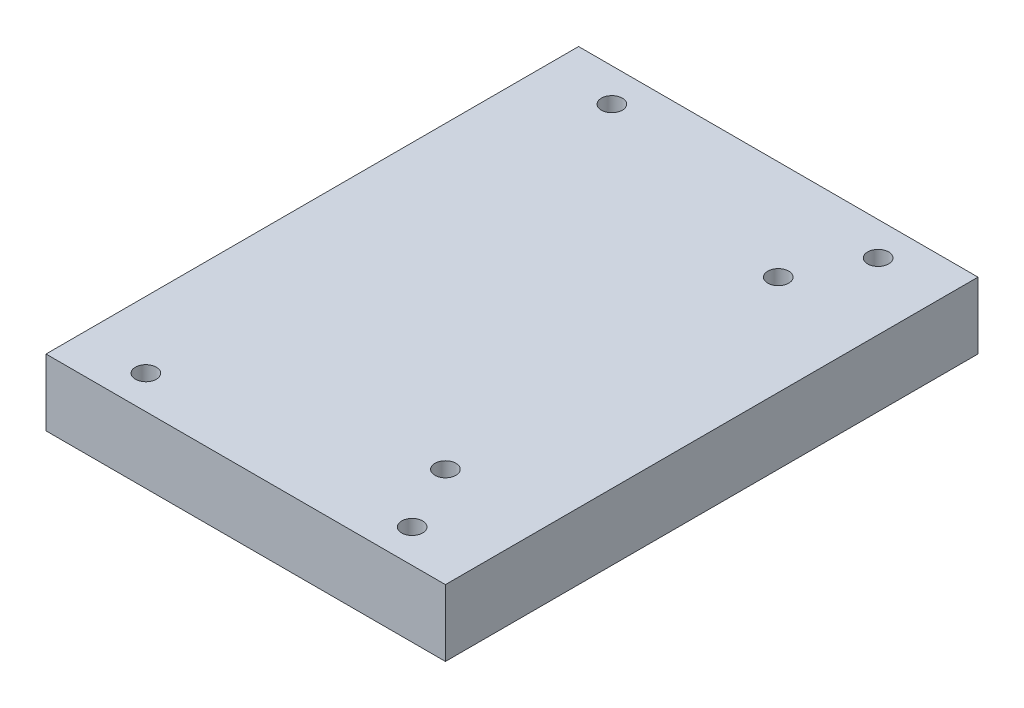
ISO-10303-21;
HEADER;
FILE_DESCRIPTION(('STEP AP214'),'2;1');
FILE_NAME('part.step','',(''),(''),'','','');
FILE_SCHEMA(('AUTOMOTIVE_DESIGN { 1 0 10303 214 1 1 1 1 }'));
ENDSEC;
DATA;
#1=APPLICATION_CONTEXT('core data for automotive mechanical design processes');
#2=APPLICATION_PROTOCOL_DEFINITION('international standard','automotive_design',2000,#1);
#3=PRODUCT_CONTEXT('',#1,'mechanical');
#4=PRODUCT('Part','Part','',(#3));
#5=PRODUCT_RELATED_PRODUCT_CATEGORY('part','',(#4));
#6=PRODUCT_DEFINITION_FORMATION('','',#4);
#7=PRODUCT_DEFINITION_CONTEXT('part definition',#1,'design');
#8=PRODUCT_DEFINITION('design','',#6,#7);
#9=PRODUCT_DEFINITION_SHAPE('','',#8);
#10=(LENGTH_UNIT() NAMED_UNIT(*) SI_UNIT(.MILLI.,.METRE.));
#11=(NAMED_UNIT(*) PLANE_ANGLE_UNIT() SI_UNIT($,.RADIAN.));
#12=(NAMED_UNIT(*) SI_UNIT($,.STERADIAN.) SOLID_ANGLE_UNIT());
#13=UNCERTAINTY_MEASURE_WITH_UNIT(LENGTH_MEASURE(1.E-05),#10,'distance_accuracy_value','');
#14=(GEOMETRIC_REPRESENTATION_CONTEXT(3) GLOBAL_UNCERTAINTY_ASSIGNED_CONTEXT((#13)) GLOBAL_UNIT_ASSIGNED_CONTEXT((#10,
#11,#12)) REPRESENTATION_CONTEXT('',''));
#15=CARTESIAN_POINT('',(0.,0.,0.));
#16=DIRECTION('',(0.,0.,1.));
#17=DIRECTION('',(1.,0.,0.));
#18=AXIS2_PLACEMENT_3D('',#15,#16,#17);
#19=CARTESIAN_POINT('',(-123.989038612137,12.7,-27.4707877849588));
#20=DIRECTION('',(1.,0.,0.));
#21=DIRECTION('',(0.,0.,-1.));
#22=AXIS2_PLACEMENT_3D('',#19,#20,#21);
#23=PLANE('',#22);
#24=DIRECTION('',(0.,0.,1.));
#25=VECTOR('',#24,1.);
#26=CARTESIAN_POINT('',(-123.989038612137,0.,-27.4707877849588));
#27=LINE('',#26,#25);
#28=CARTESIAN_POINT('',(-123.989038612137,0.,-27.4707877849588));
#29=VERTEX_POINT('',#28);
#30=CARTESIAN_POINT('',(-123.989038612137,0.,74.1292122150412));
#31=VERTEX_POINT('',#30);
#32=EDGE_CURVE('E96',#29,#31,#27,.T.);
#33=ORIENTED_EDGE('',*,*,#32,.T.);
#34=DIRECTION('',(0.,-1.,0.));
#35=VECTOR('',#34,1.);
#36=CARTESIAN_POINT('',(-123.989038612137,12.7,74.1292122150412));
#37=LINE('',#36,#35);
#38=CARTESIAN_POINT('',(-123.989038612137,12.7,74.1292122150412));
#39=VERTEX_POINT('',#38);
#40=EDGE_CURVE('E11',#39,#31,#37,.T.);
#41=ORIENTED_EDGE('',*,*,#40,.F.);
#42=DIRECTION('',(0.,0.,1.));
#43=VECTOR('',#42,1.);
#44=CARTESIAN_POINT('',(-123.989038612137,12.7,-27.4707877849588));
#45=LINE('',#44,#43);
#46=CARTESIAN_POINT('',(-123.989038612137,12.7,-27.4707877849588));
#47=VERTEX_POINT('',#46);
#48=EDGE_CURVE('E84',#47,#39,#45,.T.);
#49=ORIENTED_EDGE('',*,*,#48,.F.);
#50=DIRECTION('',(0.,-1.,0.));
#51=VECTOR('',#50,1.);
#52=CARTESIAN_POINT('',(-123.989038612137,12.7,-27.4707877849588));
#53=LINE('',#52,#51);
#54=EDGE_CURVE('E92',#47,#29,#53,.T.);
#55=ORIENTED_EDGE('',*,*,#54,.T.);
#56=EDGE_LOOP('',(#33,#41,#49,#55));
#57=FACE_BOUND('',#56,.T.);
#58=ADVANCED_FACE('F33',(#57),#23,.F.);
#59=CARTESIAN_POINT('',(-123.989038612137,12.7,74.1292122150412));
#60=DIRECTION('',(0.,0.,-1.));
#61=DIRECTION('',(-1.,0.,0.));
#62=AXIS2_PLACEMENT_3D('',#59,#60,#61);
#63=PLANE('',#62);
#64=DIRECTION('',(1.,0.,0.));
#65=VECTOR('',#64,1.);
#66=CARTESIAN_POINT('',(-123.989038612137,0.,74.1292122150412));
#67=LINE('',#66,#65);
#68=CARTESIAN_POINT('',(-47.7890386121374,0.,74.1292122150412));
#69=VERTEX_POINT('',#68);
#70=EDGE_CURVE('E88',#31,#69,#67,.T.);
#71=ORIENTED_EDGE('',*,*,#70,.T.);
#72=DIRECTION('',(0.,-1.,0.));
#73=VECTOR('',#72,1.);
#74=CARTESIAN_POINT('',(-47.7890386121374,12.7,74.1292122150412));
#75=LINE('',#74,#73);
#76=CARTESIAN_POINT('',(-47.7890386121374,12.7,74.1292122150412));
#77=VERTEX_POINT('',#76);
#78=EDGE_CURVE('E41',#77,#69,#75,.T.);
#79=ORIENTED_EDGE('',*,*,#78,.F.);
#80=DIRECTION('',(1.,0.,0.));
#81=VECTOR('',#80,1.);
#82=CARTESIAN_POINT('',(-123.989038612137,12.7,74.1292122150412));
#83=LINE('',#82,#81);
#84=EDGE_CURVE('E79',#39,#77,#83,.T.);
#85=ORIENTED_EDGE('',*,*,#84,.F.);
#86=ORIENTED_EDGE('',*,*,#40,.T.);
#87=EDGE_LOOP('',(#71,#79,#85,#86));
#88=FACE_BOUND('',#87,.T.);
#89=ADVANCED_FACE('F87',(#88),#63,.F.);
#90=CARTESIAN_POINT('',(-47.7890386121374,12.7,-27.4707877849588));
#91=DIRECTION('',(-1.,0.,0.));
#92=DIRECTION('',(0.,0.,1.));
#93=AXIS2_PLACEMENT_3D('',#90,#91,#92);
#94=PLANE('',#93);
#95=DIRECTION('',(0.,0.,-1.));
#96=VECTOR('',#95,1.);
#97=CARTESIAN_POINT('',(-47.7890386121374,0.,-27.4707877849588));
#98=LINE('',#97,#96);
#99=CARTESIAN_POINT('',(-47.7890386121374,0.,-27.4707877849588));
#100=VERTEX_POINT('',#99);
#101=EDGE_CURVE('E66',#69,#100,#98,.T.);
#102=ORIENTED_EDGE('',*,*,#101,.T.);
#103=DIRECTION('',(0.,-1.,0.));
#104=VECTOR('',#103,1.);
#105=CARTESIAN_POINT('',(-47.7890386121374,12.7,-27.4707877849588));
#106=LINE('',#105,#104);
#107=CARTESIAN_POINT('',(-47.7890386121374,12.7,-27.4707877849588));
#108=VERTEX_POINT('',#107);
#109=EDGE_CURVE('E89',#108,#100,#106,.T.);
#110=ORIENTED_EDGE('',*,*,#109,.F.);
#111=DIRECTION('',(0.,0.,-1.));
#112=VECTOR('',#111,1.);
#113=CARTESIAN_POINT('',(-47.7890386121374,12.7,-27.4707877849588));
#114=LINE('',#113,#112);
#115=EDGE_CURVE('E82',#77,#108,#114,.T.);
#116=ORIENTED_EDGE('',*,*,#115,.F.);
#117=ORIENTED_EDGE('',*,*,#78,.T.);
#118=EDGE_LOOP('',(#102,#110,#116,#117));
#119=FACE_BOUND('',#118,.T.);
#120=ADVANCED_FACE('F90',(#119),#94,.F.);
#121=CARTESIAN_POINT('',(-123.989038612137,12.7,-27.4707877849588));
#122=DIRECTION('',(0.,0.,1.));
#123=DIRECTION('',(1.,0.,0.));
#124=AXIS2_PLACEMENT_3D('',#121,#122,#123);
#125=PLANE('',#124);
#126=DIRECTION('',(-1.,0.,0.));
#127=VECTOR('',#126,1.);
#128=CARTESIAN_POINT('',(-123.989038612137,0.,-27.4707877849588));
#129=LINE('',#128,#127);
#130=EDGE_CURVE('E72',#100,#29,#129,.T.);
#131=ORIENTED_EDGE('',*,*,#130,.T.);
#132=ORIENTED_EDGE('',*,*,#54,.F.);
#133=DIRECTION('',(-1.,0.,0.));
#134=VECTOR('',#133,1.);
#135=CARTESIAN_POINT('',(-123.989038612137,12.7,-27.4707877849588));
#136=LINE('',#135,#134);
#137=EDGE_CURVE('E49',#108,#47,#136,.T.);
#138=ORIENTED_EDGE('',*,*,#137,.F.);
#139=ORIENTED_EDGE('',*,*,#109,.T.);
#140=EDGE_LOOP('',(#131,#132,#138,#139));
#141=FACE_BOUND('',#140,.T.);
#142=ADVANCED_FACE('F104',(#141),#125,.F.);
#143=CARTESIAN_POINT('',(-123.989038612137,12.7,74.1292122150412));
#144=DIRECTION('',(0.,1.,0.));
#145=DIRECTION('',(0.,0.,1.));
#146=AXIS2_PLACEMENT_3D('',#143,#144,#145);
#147=PLANE('',#146);
#148=CARTESIAN_POINT('',(-66.8390386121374,12.7,55.0792122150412));
#149=DIRECTION('',(0.,1.,0.));
#150=DIRECTION('',(0.,0.,1.));
#151=AXIS2_PLACEMENT_3D('',#148,#149,#150);
#152=CIRCLE('',#151,2.);
#153=CARTESIAN_POINT('',(-66.8390386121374,12.7,57.0792122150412));
#154=VERTEX_POINT('',#153);
#155=EDGE_CURVE('E140',#154,#154,#152,.T.);
#156=ORIENTED_EDGE('',*,*,#155,.F.);
#157=EDGE_LOOP('',(#156));
#158=FACE_BOUND('',#157,.T.);
#159=CARTESIAN_POINT('',(-66.8390386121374,12.7,-8.42078778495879));
#160=DIRECTION('',(0.,1.,0.));
#161=DIRECTION('',(0.,0.,1.));
#162=AXIS2_PLACEMENT_3D('',#159,#160,#161);
#163=CIRCLE('',#162,2.);
#164=CARTESIAN_POINT('',(-66.8390386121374,12.7,-6.42078778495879));
#165=VERTEX_POINT('',#164);
#166=EDGE_CURVE('E134',#165,#165,#163,.T.);
#167=ORIENTED_EDGE('',*,*,#166,.F.);
#168=EDGE_LOOP('',(#167));
#169=FACE_BOUND('',#168,.T.);
#170=CARTESIAN_POINT('',(-111.289038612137,12.7,67.7792122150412));
#171=DIRECTION('',(0.,1.,0.));
#172=DIRECTION('',(0.,0.,1.));
#173=AXIS2_PLACEMENT_3D('',#170,#171,#172);
#174=CIRCLE('',#173,1.99999999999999);
#175=CARTESIAN_POINT('',(-111.289038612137,12.7,69.7792122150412));
#176=VERTEX_POINT('',#175);
#177=EDGE_CURVE('E130',#176,#176,#174,.T.);
#178=ORIENTED_EDGE('',*,*,#177,.F.);
#179=EDGE_LOOP('',(#178));
#180=FACE_BOUND('',#179,.T.);
#181=CARTESIAN_POINT('',(-111.289038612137,12.7,-21.1207877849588));
#182=DIRECTION('',(0.,1.,0.));
#183=DIRECTION('',(0.,0.,1.));
#184=AXIS2_PLACEMENT_3D('',#181,#182,#183);
#185=CIRCLE('',#184,1.99999999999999);
#186=CARTESIAN_POINT('',(-111.289038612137,12.7,-19.1207877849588));
#187=VERTEX_POINT('',#186);
#188=EDGE_CURVE('E124',#187,#187,#185,.T.);
#189=ORIENTED_EDGE('',*,*,#188,.F.);
#190=EDGE_LOOP('',(#189));
#191=FACE_BOUND('',#190,.T.);
#192=CARTESIAN_POINT('',(-60.4890386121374,12.7,-21.1207877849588));
#193=DIRECTION('',(0.,1.,0.));
#194=DIRECTION('',(0.,0.,1.));
#195=AXIS2_PLACEMENT_3D('',#192,#193,#194);
#196=CIRCLE('',#195,1.99999999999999);
#197=CARTESIAN_POINT('',(-60.4890386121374,12.7,-19.1207877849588));
#198=VERTEX_POINT('',#197);
#199=EDGE_CURVE('E118',#198,#198,#196,.T.);
#200=ORIENTED_EDGE('',*,*,#199,.F.);
#201=EDGE_LOOP('',(#200));
#202=FACE_BOUND('',#201,.T.);
#203=CARTESIAN_POINT('',(-60.4890386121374,12.7,67.7792122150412));
#204=DIRECTION('',(0.,1.,0.));
#205=DIRECTION('',(0.,0.,1.));
#206=AXIS2_PLACEMENT_3D('',#203,#204,#205);
#207=CIRCLE('',#206,1.99999999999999);
#208=CARTESIAN_POINT('',(-60.4890386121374,12.7,69.7792122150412));
#209=VERTEX_POINT('',#208);
#210=EDGE_CURVE('E112',#209,#209,#207,.T.);
#211=ORIENTED_EDGE('',*,*,#210,.F.);
#212=EDGE_LOOP('',(#211));
#213=FACE_BOUND('',#212,.T.);
#214=ORIENTED_EDGE('',*,*,#48,.T.);
#215=ORIENTED_EDGE('',*,*,#84,.T.);
#216=ORIENTED_EDGE('',*,*,#115,.T.);
#217=ORIENTED_EDGE('',*,*,#137,.T.);
#218=EDGE_LOOP('',(#214,#215,#216,#217));
#219=FACE_BOUND('',#218,.T.);
#220=ADVANCED_FACE('F80',(#158,#169,#180,#191,#202,#213,#219),#147,.T.);
#221=CARTESIAN_POINT('',(-123.989038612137,0.,74.1292122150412));
#222=DIRECTION('',(0.,1.,0.));
#223=DIRECTION('',(0.,0.,1.));
#224=AXIS2_PLACEMENT_3D('',#221,#222,#223);
#225=PLANE('',#224);
#226=CARTESIAN_POINT('',(-66.8390386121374,0.,55.0792122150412));
#227=DIRECTION('',(0.,1.,0.));
#228=DIRECTION('',(0.,0.,1.));
#229=AXIS2_PLACEMENT_3D('',#226,#227,#228);
#230=CIRCLE('',#229,2.);
#231=CARTESIAN_POINT('',(-66.8390386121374,0.,57.0792122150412));
#232=VERTEX_POINT('',#231);
#233=EDGE_CURVE('E137',#232,#232,#230,.T.);
#234=ORIENTED_EDGE('',*,*,#233,.T.);
#235=EDGE_LOOP('',(#234));
#236=FACE_BOUND('',#235,.T.);
#237=CARTESIAN_POINT('',(-66.8390386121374,0.,-8.42078778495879));
#238=DIRECTION('',(0.,1.,0.));
#239=DIRECTION('',(0.,0.,1.));
#240=AXIS2_PLACEMENT_3D('',#237,#238,#239);
#241=CIRCLE('',#240,2.);
#242=CARTESIAN_POINT('',(-66.8390386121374,0.,-6.42078778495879));
#243=VERTEX_POINT('',#242);
#244=EDGE_CURVE('E133',#243,#243,#241,.T.);
#245=ORIENTED_EDGE('',*,*,#244,.T.);
#246=EDGE_LOOP('',(#245));
#247=FACE_BOUND('',#246,.T.);
#248=CARTESIAN_POINT('',(-111.289038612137,0.,67.7792122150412));
#249=DIRECTION('',(0.,1.,0.));
#250=DIRECTION('',(0.,0.,1.));
#251=AXIS2_PLACEMENT_3D('',#248,#249,#250);
#252=CIRCLE('',#251,1.99999999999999);
#253=CARTESIAN_POINT('',(-111.289038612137,0.,69.7792122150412));
#254=VERTEX_POINT('',#253);
#255=EDGE_CURVE('E127',#254,#254,#252,.T.);
#256=ORIENTED_EDGE('',*,*,#255,.T.);
#257=EDGE_LOOP('',(#256));
#258=FACE_BOUND('',#257,.T.);
#259=CARTESIAN_POINT('',(-111.289038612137,0.,-21.1207877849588));
#260=DIRECTION('',(0.,1.,0.));
#261=DIRECTION('',(0.,0.,1.));
#262=AXIS2_PLACEMENT_3D('',#259,#260,#261);
#263=CIRCLE('',#262,1.99999999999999);
#264=CARTESIAN_POINT('',(-111.289038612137,0.,-19.1207877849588));
#265=VERTEX_POINT('',#264);
#266=EDGE_CURVE('E121',#265,#265,#263,.T.);
#267=ORIENTED_EDGE('',*,*,#266,.T.);
#268=EDGE_LOOP('',(#267));
#269=FACE_BOUND('',#268,.T.);
#270=CARTESIAN_POINT('',(-60.4890386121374,0.,-21.1207877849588));
#271=DIRECTION('',(0.,1.,0.));
#272=DIRECTION('',(0.,0.,1.));
#273=AXIS2_PLACEMENT_3D('',#270,#271,#272);
#274=CIRCLE('',#273,1.99999999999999);
#275=CARTESIAN_POINT('',(-60.4890386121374,0.,-19.1207877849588));
#276=VERTEX_POINT('',#275);
#277=EDGE_CURVE('E115',#276,#276,#274,.T.);
#278=ORIENTED_EDGE('',*,*,#277,.T.);
#279=EDGE_LOOP('',(#278));
#280=FACE_BOUND('',#279,.T.);
#281=CARTESIAN_POINT('',(-60.4890386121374,0.,67.7792122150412));
#282=DIRECTION('',(0.,1.,0.));
#283=DIRECTION('',(0.,0.,1.));
#284=AXIS2_PLACEMENT_3D('',#281,#282,#283);
#285=CIRCLE('',#284,1.99999999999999);
#286=CARTESIAN_POINT('',(-60.4890386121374,0.,69.7792122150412));
#287=VERTEX_POINT('',#286);
#288=EDGE_CURVE('E99',#287,#287,#285,.T.);
#289=ORIENTED_EDGE('',*,*,#288,.T.);
#290=EDGE_LOOP('',(#289));
#291=FACE_BOUND('',#290,.T.);
#292=ORIENTED_EDGE('',*,*,#32,.F.);
#293=ORIENTED_EDGE('',*,*,#130,.F.);
#294=ORIENTED_EDGE('',*,*,#101,.F.);
#295=ORIENTED_EDGE('',*,*,#70,.F.);
#296=EDGE_LOOP('',(#292,#293,#294,#295));
#297=FACE_BOUND('',#296,.T.);
#298=ADVANCED_FACE('F107',(#236,#247,#258,#269,#280,#291,#297),#225,.F.);
#299=CARTESIAN_POINT('',(-60.4890386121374,12.7,67.7792122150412));
#300=DIRECTION('',(0.,1.,0.));
#301=DIRECTION('',(0.,0.,1.));
#302=AXIS2_PLACEMENT_3D('',#299,#300,#301);
#303=CYLINDRICAL_SURFACE('',#302,1.99999999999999);
#304=ORIENTED_EDGE('',*,*,#288,.F.);
#305=EDGE_LOOP('',(#304));
#306=FACE_BOUND('',#305,.T.);
#307=ORIENTED_EDGE('',*,*,#210,.T.);
#308=EDGE_LOOP('',(#307));
#309=FACE_BOUND('',#308,.T.);
#310=ADVANCED_FACE('F168',(#306,#309),#303,.F.);
#311=CARTESIAN_POINT('',(-60.4890386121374,12.7,-21.1207877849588));
#312=DIRECTION('',(0.,1.,0.));
#313=DIRECTION('',(0.,0.,1.));
#314=AXIS2_PLACEMENT_3D('',#311,#312,#313);
#315=CYLINDRICAL_SURFACE('',#314,1.99999999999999);
#316=ORIENTED_EDGE('',*,*,#277,.F.);
#317=EDGE_LOOP('',(#316));
#318=FACE_BOUND('',#317,.T.);
#319=ORIENTED_EDGE('',*,*,#199,.T.);
#320=EDGE_LOOP('',(#319));
#321=FACE_BOUND('',#320,.T.);
#322=ADVANCED_FACE('F170',(#318,#321),#315,.F.);
#323=CARTESIAN_POINT('',(-111.289038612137,12.7,-21.1207877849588));
#324=DIRECTION('',(0.,1.,0.));
#325=DIRECTION('',(0.,0.,1.));
#326=AXIS2_PLACEMENT_3D('',#323,#324,#325);
#327=CYLINDRICAL_SURFACE('',#326,1.99999999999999);
#328=ORIENTED_EDGE('',*,*,#266,.F.);
#329=EDGE_LOOP('',(#328));
#330=FACE_BOUND('',#329,.T.);
#331=ORIENTED_EDGE('',*,*,#188,.T.);
#332=EDGE_LOOP('',(#331));
#333=FACE_BOUND('',#332,.T.);
#334=ADVANCED_FACE('F177',(#330,#333),#327,.F.);
#335=CARTESIAN_POINT('',(-111.289038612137,12.7,67.7792122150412));
#336=DIRECTION('',(0.,1.,0.));
#337=DIRECTION('',(0.,0.,1.));
#338=AXIS2_PLACEMENT_3D('',#335,#336,#337);
#339=CYLINDRICAL_SURFACE('',#338,1.99999999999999);
#340=ORIENTED_EDGE('',*,*,#255,.F.);
#341=EDGE_LOOP('',(#340));
#342=FACE_BOUND('',#341,.T.);
#343=ORIENTED_EDGE('',*,*,#177,.T.);
#344=EDGE_LOOP('',(#343));
#345=FACE_BOUND('',#344,.T.);
#346=ADVANCED_FACE('F215',(#342,#345),#339,.F.);
#347=CARTESIAN_POINT('',(-66.8390386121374,0.,-8.42078778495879));
#348=DIRECTION('',(0.,1.,0.));
#349=DIRECTION('',(0.,0.,1.));
#350=AXIS2_PLACEMENT_3D('',#347,#348,#349);
#351=CYLINDRICAL_SURFACE('',#350,2.);
#352=ORIENTED_EDGE('',*,*,#244,.F.);
#353=EDGE_LOOP('',(#352));
#354=FACE_BOUND('',#353,.T.);
#355=ORIENTED_EDGE('',*,*,#166,.T.);
#356=EDGE_LOOP('',(#355));
#357=FACE_BOUND('',#356,.T.);
#358=ADVANCED_FACE('F151',(#354,#357),#351,.F.);
#359=CARTESIAN_POINT('',(-66.8390386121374,0.,55.0792122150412));
#360=DIRECTION('',(0.,1.,0.));
#361=DIRECTION('',(0.,0.,1.));
#362=AXIS2_PLACEMENT_3D('',#359,#360,#361);
#363=CYLINDRICAL_SURFACE('',#362,2.);
#364=ORIENTED_EDGE('',*,*,#233,.F.);
#365=EDGE_LOOP('',(#364));
#366=FACE_BOUND('',#365,.T.);
#367=ORIENTED_EDGE('',*,*,#155,.T.);
#368=EDGE_LOOP('',(#367));
#369=FACE_BOUND('',#368,.T.);
#370=ADVANCED_FACE('F148',(#366,#369),#363,.F.);
#371=CLOSED_SHELL('',(#58,#89,#120,#142,#220,#298,#310,#322,#334,#346,#358,#370));
#372=MANIFOLD_SOLID_BREP('B2',#371);
#373=ADVANCED_BREP_SHAPE_REPRESENTATION('',(#18,#372),#14);
#374=SHAPE_DEFINITION_REPRESENTATION(#9,#373);
ENDSEC;
END-ISO-10303-21;
